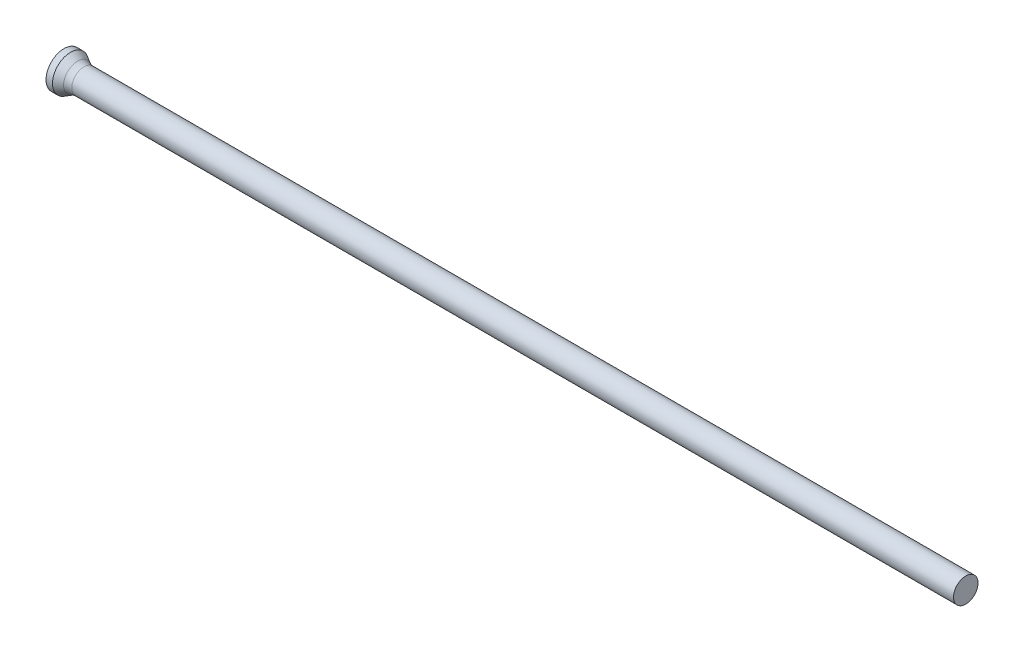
ISO-10303-21;
HEADER;
FILE_DESCRIPTION(('STEP AP214'),'2;1');
FILE_NAME('part.step','',(''),(''),'','','');
FILE_SCHEMA(('AUTOMOTIVE_DESIGN { 1 0 10303 214 1 1 1 1 }'));
ENDSEC;
DATA;
#1=APPLICATION_CONTEXT('core data for automotive mechanical design processes');
#2=APPLICATION_PROTOCOL_DEFINITION('international standard','automotive_design',2000,#1);
#3=PRODUCT_CONTEXT('',#1,'mechanical');
#4=PRODUCT('Part','Part','',(#3));
#5=PRODUCT_RELATED_PRODUCT_CATEGORY('part','',(#4));
#6=PRODUCT_DEFINITION_FORMATION('','',#4);
#7=PRODUCT_DEFINITION_CONTEXT('part definition',#1,'design');
#8=PRODUCT_DEFINITION('design','',#6,#7);
#9=PRODUCT_DEFINITION_SHAPE('','',#8);
#10=(LENGTH_UNIT() NAMED_UNIT(*) SI_UNIT(.MILLI.,.METRE.));
#11=(NAMED_UNIT(*) PLANE_ANGLE_UNIT() SI_UNIT($,.RADIAN.));
#12=(NAMED_UNIT(*) SI_UNIT($,.STERADIAN.) SOLID_ANGLE_UNIT());
#13=UNCERTAINTY_MEASURE_WITH_UNIT(LENGTH_MEASURE(1.E-05),#10,'distance_accuracy_value','');
#14=(GEOMETRIC_REPRESENTATION_CONTEXT(3) GLOBAL_UNCERTAINTY_ASSIGNED_CONTEXT((#13)) GLOBAL_UNIT_ASSIGNED_CONTEXT((#10,
#11,#12)) REPRESENTATION_CONTEXT('',''));
#15=CARTESIAN_POINT('',(0.,0.,0.));
#16=DIRECTION('',(0.,0.,1.));
#17=DIRECTION('',(1.,0.,0.));
#18=AXIS2_PLACEMENT_3D('',#15,#16,#17);
#19=CARTESIAN_POINT('',(0.,0.,0.));
#20=DIRECTION('',(1.,0.,0.));
#21=DIRECTION('',(0.,0.,-1.));
#22=AXIS2_PLACEMENT_3D('',#19,#20,#21);
#23=PLANE('',#22);
#24=CARTESIAN_POINT('',(0.,0.,0.));
#25=DIRECTION('',(-1.,0.,0.));
#26=DIRECTION('',(0.,0.,1.));
#27=AXIS2_PLACEMENT_3D('',#24,#25,#26);
#28=CIRCLE('',#27,1.4);
#29=CARTESIAN_POINT('',(0.,0.,1.4));
#30=VERTEX_POINT('',#29);
#31=EDGE_CURVE('E25',#30,#30,#28,.T.);
#32=ORIENTED_EDGE('',*,*,#31,.T.);
#33=EDGE_LOOP('',(#32));
#34=FACE_BOUND('',#33,.T.);
#35=ADVANCED_FACE('F14',(#34),#23,.F.);
#36=CARTESIAN_POINT('',(0.,0.,0.));
#37=DIRECTION('',(-1.,0.,0.));
#38=DIRECTION('',(0.,0.,1.));
#39=AXIS2_PLACEMENT_3D('',#36,#37,#38);
#40=CYLINDRICAL_SURFACE('',#39,1.4);
#41=ORIENTED_EDGE('',*,*,#31,.F.);
#42=EDGE_LOOP('',(#41));
#43=FACE_BOUND('',#42,.T.);
#44=CARTESIAN_POINT('',(0.500577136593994,0.,0.));
#45=DIRECTION('',(-1.,0.,0.));
#46=DIRECTION('',(0.,0.,1.));
#47=AXIS2_PLACEMENT_3D('',#44,#45,#46);
#48=CIRCLE('',#47,1.4);
#49=CARTESIAN_POINT('',(0.500577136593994,0.,1.4));
#50=VERTEX_POINT('',#49);
#51=EDGE_CURVE('E29',#50,#50,#48,.T.);
#52=ORIENTED_EDGE('',*,*,#51,.T.);
#53=EDGE_LOOP('',(#52));
#54=FACE_BOUND('',#53,.T.);
#55=ADVANCED_FACE('F53',(#43,#54),#40,.T.);
#56=CARTESIAN_POINT('',(1.28,0.,0.));
#57=DIRECTION('',(-1.,0.,0.));
#58=DIRECTION('',(0.,0.,1.));
#59=AXIS2_PLACEMENT_3D('',#56,#57,#58);
#60=CONICAL_SURFACE('',#59,0.95,0.523598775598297);
#61=CARTESIAN_POINT('',(1.04794919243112,0.,0.));
#62=DIRECTION('',(-1.,0.,0.));
#63=DIRECTION('',(0.,0.,1.));
#64=AXIS2_PLACEMENT_3D('',#61,#62,#63);
#65=CIRCLE('',#64,1.08397459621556);
#66=CARTESIAN_POINT('',(1.04794919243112,0.,1.08397459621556));
#67=VERTEX_POINT('',#66);
#68=EDGE_CURVE('E21',#67,#67,#65,.T.);
#69=ORIENTED_EDGE('',*,*,#68,.T.);
#70=EDGE_LOOP('',(#69));
#71=FACE_BOUND('',#70,.T.);
#72=ORIENTED_EDGE('',*,*,#51,.F.);
#73=EDGE_LOOP('',(#72));
#74=FACE_BOUND('',#73,.T.);
#75=ADVANCED_FACE('F50',(#71,#74),#60,.T.);
#76=CARTESIAN_POINT('',(0.,0.,0.));
#77=DIRECTION('',(-1.,0.,0.));
#78=DIRECTION('',(0.,0.,1.));
#79=AXIS2_PLACEMENT_3D('',#76,#77,#78);
#80=CYLINDRICAL_SURFACE('',#79,0.95);
#81=CARTESIAN_POINT('',(1.54794919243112,0.,0.));
#82=DIRECTION('',(-1.,0.,0.));
#83=DIRECTION('',(0.,0.,1.));
#84=AXIS2_PLACEMENT_3D('',#81,#82,#83);
#85=CIRCLE('',#84,0.95);
#86=CARTESIAN_POINT('',(1.54794919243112,0.,0.95));
#87=VERTEX_POINT('',#86);
#88=EDGE_CURVE('E9',#87,#87,#85,.F.);
#89=ORIENTED_EDGE('',*,*,#88,.T.);
#90=EDGE_LOOP('',(#89));
#91=FACE_BOUND('',#90,.T.);
#92=CARTESIAN_POINT('',(70.,0.,0.));
#93=DIRECTION('',(-1.,0.,0.));
#94=DIRECTION('',(0.,0.,1.));
#95=AXIS2_PLACEMENT_3D('',#92,#93,#94);
#96=CIRCLE('',#95,0.95);
#97=CARTESIAN_POINT('',(70.,0.,0.95));
#98=VERTEX_POINT('',#97);
#99=EDGE_CURVE('E34',#98,#98,#96,.T.);
#100=ORIENTED_EDGE('',*,*,#99,.T.);
#101=EDGE_LOOP('',(#100));
#102=FACE_BOUND('',#101,.T.);
#103=ADVANCED_FACE('F38',(#91,#102),#80,.T.);
#104=CARTESIAN_POINT('',(70.,0.95,0.));
#105=DIRECTION('',(-1.,0.,0.));
#106=DIRECTION('',(0.,0.,1.));
#107=AXIS2_PLACEMENT_3D('',#104,#105,#106);
#108=PLANE('',#107);
#109=ORIENTED_EDGE('',*,*,#99,.F.);
#110=EDGE_LOOP('',(#109));
#111=FACE_BOUND('',#110,.T.);
#112=ADVANCED_FACE('F40',(#111),#108,.F.);
#113=CARTESIAN_POINT('',(1.54794919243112,0.,0.));
#114=DIRECTION('',(-1.,0.,0.));
#115=DIRECTION('',(0.,0.,1.));
#116=AXIS2_PLACEMENT_3D('',#113,#114,#115);
#117=TOROIDAL_SURFACE('',#116,1.95,1.);
#118=ORIENTED_EDGE('',*,*,#88,.F.);
#119=EDGE_LOOP('',(#118));
#120=FACE_BOUND('',#119,.T.);
#121=ORIENTED_EDGE('',*,*,#68,.F.);
#122=EDGE_LOOP('',(#121));
#123=FACE_BOUND('',#122,.T.);
#124=ADVANCED_FACE('F16',(#120,#123),#117,.F.);
#125=CLOSED_SHELL('',(#35,#55,#75,#103,#112,#124));
#126=MANIFOLD_SOLID_BREP('B1',#125);
#127=ADVANCED_BREP_SHAPE_REPRESENTATION('',(#18,#126),#14);
#128=SHAPE_DEFINITION_REPRESENTATION(#9,#127);
ENDSEC;
END-ISO-10303-21;
